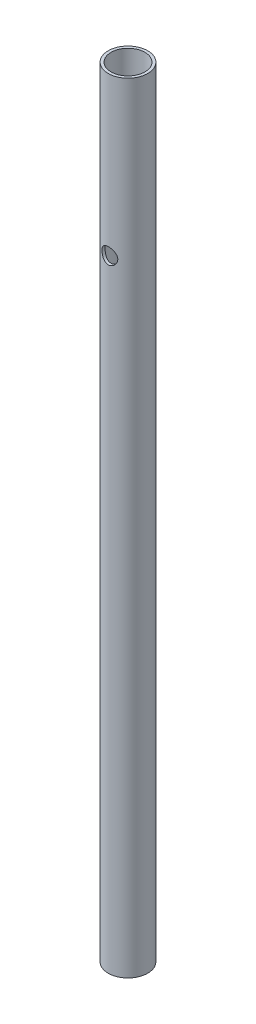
from build123d import *

# Parameters (mm, degrees)
SKETCH1_R               = 6.35
SKETCH1_R_2             = 5.461
BOSS_EXTRUDE1_DEPTH     = 250.825
CUT_EXTRUDE1_DEPTH      = 251.985708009
CUT_EXTRUDE1_DEPTH_BACK = 251.985708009
SKETCH2_R               = 2.54


with BuildPart() as part:
    # Sketch1 → Boss-Extrude1 (new body)
    with BuildSketch(Plane(origin=(0, 0, 0), x_dir=(1, 0, 0), z_dir=(0, 1, 0))):
        with Locations(Location((0, 0, 0), (0, 0, 270))):
            Circle(SKETCH1_R)
        with Locations(Location((0, 0, 0), (0, 0, 270))):
            Circle(SKETCH1_R_2, mode=Mode.SUBTRACT)
    extrude(amount=BOSS_EXTRUDE1_DEPTH)

    # Sketch2 → Cut-Extrude1 (cut, two sides: drawn at the far end of the back side and taken through both)
    with BuildSketch(Plane.XY.offset(-CUT_EXTRUDE1_DEPTH_BACK)):
        with Locations((0, 200.025)):
            Circle(SKETCH2_R)
    extrude(amount=CUT_EXTRUDE1_DEPTH + CUT_EXTRUDE1_DEPTH_BACK, mode=Mode.SUBTRACT)


solid = part.part
